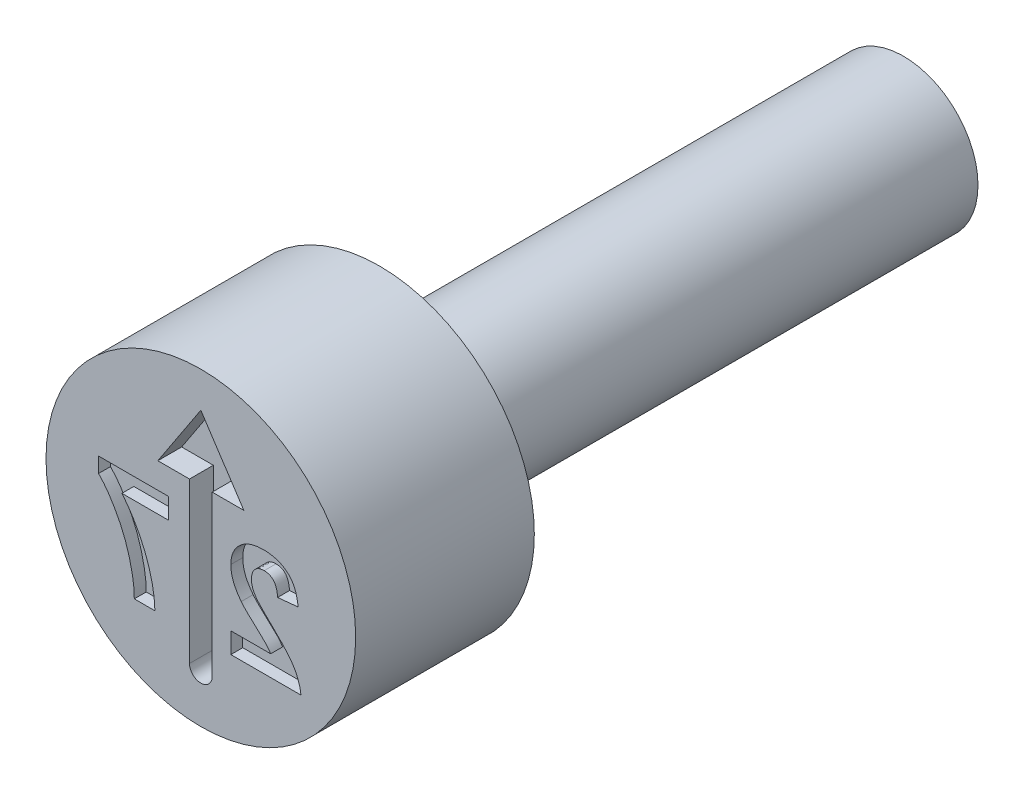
from build123d import *

# Parameters (mm, degrees)
CUT_EXTRUDE4_DEPTH = 0.4
CUT_EXTRUDE5_DEPTH = 0.2


with BuildPart() as part:
    # Sketch2 → Revolve1 (revolve)
    with BuildSketch(Plane(origin=(0, 0, 0), x_dir=(0, 0, -1), z_dir=(1, 0, 0)), mode=Mode.PRIVATE) as revolve1_sk:
        Polygon((0, 2.6), (0, 0), (11.8, 0), (11.8, 1.25), (3, 1.25), (3, 2.6), align=None)
    revolve(revolve1_sk.sketch.rotate(Axis((0, 0, -0.403888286), (0, 0, -1)), 90), axis=Axis((0, 0, -0.403888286), (0, 0, -1)))

    # Sketch3 → Cut-Extrude4 (cut)
    with BuildSketch(Plane.XY):
        with BuildLine():
            Line((0.190473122, 0.906351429), (0.190473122, -1.776161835))
            ThreePointArc((0.190473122, -1.776161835), (0, -1.966634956), (-0.190473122, -1.776161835))
            Line((-0.190473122, -1.776161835), (-0.190473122, 0.906351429))
            Line((-0.190473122, 0.906351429), (-0.721917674, 0.906351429))
            Line((-0.721917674, 0.906351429), (0, 2.002115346))
            Line((0, 2.002115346), (0.721917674, 0.906351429))
            Line((0.721917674, 0.906351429), (0.190473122, 0.906351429))
        make_face()
    extrude(amount=-CUT_EXTRUDE4_DEPTH, mode=Mode.SUBTRACT)

    # Sketch4 → Cut-Extrude5 (cut)
    with BuildSketch(Plane.XY):
        with BuildLine():
            Line((0.503766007, -0.953846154), (0.503766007, -1.3))
            Line((0.503766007, -1.3), (1.680689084, -1.3))
            add(Edge.make_bspline(
                [(1.680689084, -1.3), (1.676704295, -1.270416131), (1.668736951, -1.211264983), (1.644104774, -1.124860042), (1.611229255, -1.040543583), (1.575549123, -0.971930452), (1.54006128, -0.916699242), (1.507863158, -0.871442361), (1.469451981, -0.823290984), (1.425385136, -0.771856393), (1.375906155, -0.716977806), (1.320645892, -0.658859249), (1.259340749, -0.597778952), (1.216211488, -0.556302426), (1.193910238, -0.534855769)],
                knots=[0, 0, 0, 0, 1.156289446, 2.311930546, 3.473459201, 4.661751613, 5.303057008, 6.018253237, 6.81459331, 7.690699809, 8.644447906, 9.679642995, 10.800191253, 12, 12, 12, 12], degree=3))
            add(Edge.make_bspline(
                [(1.193910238, -0.534855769), (1.176113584, -0.517677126), (1.142233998, -0.48497405), (1.093989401, -0.43814457), (1.051577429, -0.395094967), (1.014111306, -0.356940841), (0.982456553, -0.322710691), (0.956196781, -0.292942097), (0.934999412, -0.267513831), (0.923518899, -0.251382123), (0.918429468, -0.244230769)],
                knots=[0, 0, 0, 0, 1.480720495, 2.818855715, 4.024636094, 5.098235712, 6.019786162, 6.815086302, 7.474715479, 8, 8, 8, 8], degree=3))
            add(Edge.make_bspline(
                [(0.918429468, -0.244230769), (0.908007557, -0.226918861), (0.887904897, -0.193526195), (0.865860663, -0.141015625), (0.852628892, -0.088515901), (0.850813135, -0.053435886), (0.849919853, -0.036177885)],
                knots=[0, 0, 0, 0, 1.0911822, 2.104764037, 3.067617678, 4, 4, 4, 4], degree=3))
            add(Edge.make_bspline(
                [(0.849919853, -0.036177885), (0.850568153, -0.018218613), (0.851794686, 0.015758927), (0.862079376, 0.06370752), (0.880317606, 0.104926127), (0.905428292, 0.139541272), (0.937180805, 0.166662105), (0.974300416, 0.186701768), (1.017330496, 0.19778109), (1.047574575, 0.199238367), (1.063381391, 0.2)],
                knots=[0, 0, 0, 0, 1.193122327, 2.257294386, 3.237245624, 4.168877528, 5.075331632, 5.990371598, 6.949684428, 8, 8, 8, 8], degree=3))
            add(Edge.make_bspline(
                [(1.063381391, 0.2), (1.079081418, 0.199288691), (1.109410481, 0.197914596), (1.152514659, 0.185910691), (1.190222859, 0.165130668), (1.217095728, 0.141449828), (1.235249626, 0.11842193), (1.247619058, 0.098354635), (1.258280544, 0.075552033), (1.267727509, 0.050270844), (1.275189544, 0.022221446), (1.281199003, -0.008382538), (1.286041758, -0.041705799), (1.287581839, -0.064887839), (1.288381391, -0.076923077)],
                knots=[0, 0, 0, 0, 1.402788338, 2.709884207, 3.961032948, 5.225417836, 5.883680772, 6.578928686, 7.329201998, 8.132101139, 8.990263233, 9.922304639, 10.921339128, 12, 12, 12, 12], degree=3))
            Line((1.288381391, -0.076923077), (1.634535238, -0.043028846))
            add(Edge.make_bspline(
                [(1.634535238, -0.043028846), (1.631752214, -0.019659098), (1.626356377, 0.025651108), (1.612890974, 0.090732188), (1.59583754, 0.150772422), (1.57438308, 0.205660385), (1.549414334, 0.255745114), (1.519657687, 0.300275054), (1.486152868, 0.339743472), (1.448870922, 0.374129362), (1.408048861, 0.403542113), (1.365213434, 0.429797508), (1.319527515, 0.451335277), (1.271494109, 0.469085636), (1.221134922, 0.48327158), (1.168217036, 0.492651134), (1.113067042, 0.499248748), (1.075421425, 0.499745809), (1.056169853, 0.5)],
                knots=[0, 0, 0, 0, 1.270971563, 2.464210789, 3.586263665, 4.638946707, 5.643716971, 6.603612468, 7.52484387, 8.434700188, 9.336036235, 10.239171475, 11.145359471, 12.059630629, 13.003312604, 13.96741569, 14.960557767, 16, 16, 16, 16], degree=3))
            add(Edge.make_bspline(
                [(1.056169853, 0.5), (1.035240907, 0.499597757), (0.994479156, 0.498814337), (0.934974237, 0.492344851), (0.87907364, 0.481064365), (0.826288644, 0.466121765), (0.777161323, 0.446172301), (0.7312823, 0.422054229), (0.689373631, 0.392852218), (0.65081061, 0.360158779), (0.616338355, 0.324206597), (0.586143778, 0.285857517), (0.560846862, 0.245138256), (0.539618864, 0.202545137), (0.523857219, 0.157392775), (0.512372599, 0.110305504), (0.504757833, 0.06106365), (0.504100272, 0.027432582), (0.503766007, 0.010336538)],
                knots=[0, 0, 0, 0, 1.210756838, 2.35810096, 3.457354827, 4.507168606, 5.527358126, 6.519769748, 7.499700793, 8.476517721, 9.440526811, 10.376769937, 11.295256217, 12.209626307, 13.124630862, 14.055668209, 15.011616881, 16, 16, 16, 16], degree=3))
            add(Edge.make_bspline(
                [(0.503766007, 0.010336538), (0.504206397, -0.009284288), (0.505080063, -0.048208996), (0.513444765, -0.105751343), (0.526224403, -0.161966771), (0.545111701, -0.216992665), (0.569052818, -0.272148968), (0.599913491, -0.327559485), (0.635745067, -0.384895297), (0.663799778, -0.421965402), (0.678285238, -0.441105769)],
                knots=[0, 0, 0, 0, 0.953409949, 1.89141903, 2.821310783, 3.752688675, 4.715703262, 5.740811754, 6.833515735, 8, 8, 8, 8], degree=3))
            add(Edge.make_bspline(
                [(0.678285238, -0.441105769), (0.683760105, -0.448001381), (0.695486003, -0.462770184), (0.715434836, -0.485415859), (0.738553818, -0.510152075), (0.764516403, -0.537441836), (0.794180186, -0.566318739), (0.826477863, -0.597990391), (0.862830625, -0.630836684), (0.900483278, -0.665676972), (0.938299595, -0.699586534), (0.973058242, -0.7317931), (1.00463066, -0.760288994), (1.031546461, -0.78664732), (1.055388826, -0.809069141), (1.075298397, -0.828704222), (1.091647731, -0.845077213), (1.114176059, -0.870598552), (1.142840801, -0.905116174), (1.163007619, -0.938098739), (1.172636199, -0.953846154)],
                knots=[0, 0, 0, 0, 0.665555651, 1.425465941, 2.280616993, 3.225313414, 4.272635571, 5.410053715, 6.644756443, 7.976022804, 9.288331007, 10.484517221, 11.558462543, 12.503158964, 13.33222979, 14.032602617, 14.617328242, 15.080653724, 16.606167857, 18, 18, 18, 18], degree=3))
            Line((1.172636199, -0.953846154), (0.503766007, -0.953846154))
        make_face()
        with BuildLine():
            Line((-0.540233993, 0.130769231), (-0.540233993, 0.476923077))
            Line((-0.540233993, 0.476923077), (-1.71715707, 0.476923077))
            Line((-1.71715707, 0.476923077), (-1.71715707, 0.223076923))
            add(Edge.make_bspline(
                [(-1.71715707, 0.223076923), (-1.704879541, 0.210584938), (-1.679640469, 0.184905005), (-1.643487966, 0.142877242), (-1.606799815, 0.097269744), (-1.570343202, 0.047467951), (-1.53298489, -0.00574143), (-1.496366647, -0.063378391), (-1.459227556, -0.124695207), (-1.409226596, -0.211427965), (-1.350781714, -0.324727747), (-1.28895012, -0.465565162), (-1.236272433, -0.610727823), (-1.200201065, -0.734417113), (-1.17582905, -0.833553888), (-1.159905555, -0.906045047), (-1.146501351, -0.976496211), (-1.13559704, -1.045031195), (-1.127458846, -1.111681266), (-1.121028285, -1.176214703), (-1.117855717, -1.238788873), (-1.117387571, -1.279804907), (-1.11715707, -1.3)],
                knots=[0, 0, 0, 0, 0.628545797, 1.29210959, 1.98878689, 2.729126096, 3.507039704, 4.322017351, 5.179550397, 6.080149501, 7.915136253, 9.752312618, 11.597470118, 13.454141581, 14.373891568, 15.261584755, 16.117868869, 16.947726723, 17.752002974, 18.527724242, 19.275094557, 20, 20, 20, 20], degree=3))
            Line((-1.11715707, -1.3), (-0.771003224, -1.3))
            add(Edge.make_bspline(
                [(-0.771003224, -1.3), (-0.772160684, -1.269334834), (-0.774488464, -1.207663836), (-0.783197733, -1.115097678), (-0.796876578, -1.022186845), (-0.813866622, -0.928716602), (-0.836297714, -0.834914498), (-0.861898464, -0.740433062), (-0.892909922, -0.645776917), (-0.927672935, -0.551127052), (-0.966049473, -0.457382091), (-1.007874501, -0.365704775), (-1.053039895, -0.276667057), (-1.100958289, -0.189956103), (-1.152187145, -0.105850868), (-1.206765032, -0.024442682), (-1.263917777, 0.054857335), (-1.304782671, 0.105469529), (-1.325209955, 0.130769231)],
                knots=[0, 0, 0, 0, 0.943249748, 1.896978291, 2.856365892, 3.829648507, 4.816416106, 5.820376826, 6.838120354, 7.877341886, 8.919613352, 9.951365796, 10.974227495, 11.988073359, 12.996274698, 14.000568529, 15.000536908, 16, 16, 16, 16], degree=3))
            Line((-1.325209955, 0.130769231), (-0.540233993, 0.130769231))
        make_face()
    extrude(amount=-CUT_EXTRUDE5_DEPTH, mode=Mode.SUBTRACT)


solid = part.part
